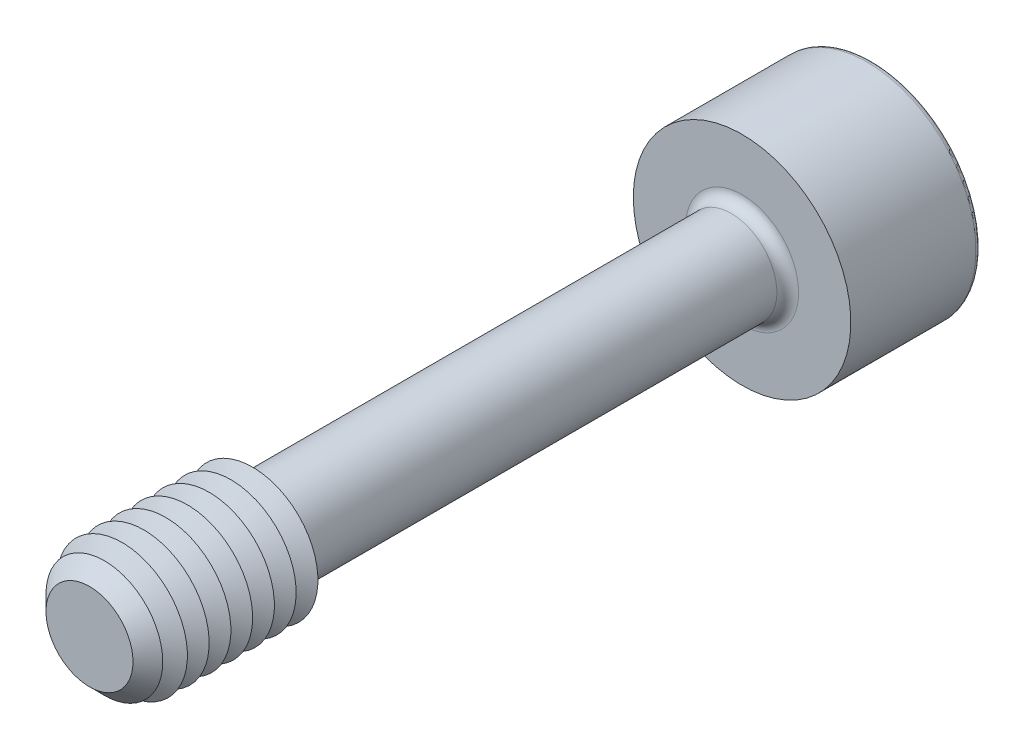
ISO-10303-21;
HEADER;
FILE_DESCRIPTION(('STEP AP214'),'2;1');
FILE_NAME('part.step','',(''),(''),'','','');
FILE_SCHEMA(('AUTOMOTIVE_DESIGN { 1 0 10303 214 1 1 1 1 }'));
ENDSEC;
DATA;
#1=APPLICATION_CONTEXT('core data for automotive mechanical design processes');
#2=APPLICATION_PROTOCOL_DEFINITION('international standard','automotive_design',2000,#1);
#3=PRODUCT_CONTEXT('',#1,'mechanical');
#4=PRODUCT('Part','Part','',(#3));
#5=PRODUCT_RELATED_PRODUCT_CATEGORY('part','',(#4));
#6=PRODUCT_DEFINITION_FORMATION('','',#4);
#7=PRODUCT_DEFINITION_CONTEXT('part definition',#1,'design');
#8=PRODUCT_DEFINITION('design','',#6,#7);
#9=PRODUCT_DEFINITION_SHAPE('','',#8);
#10=(LENGTH_UNIT() NAMED_UNIT(*) SI_UNIT(.MILLI.,.METRE.));
#11=(NAMED_UNIT(*) PLANE_ANGLE_UNIT() SI_UNIT($,.RADIAN.));
#12=(NAMED_UNIT(*) SI_UNIT($,.STERADIAN.) SOLID_ANGLE_UNIT());
#13=UNCERTAINTY_MEASURE_WITH_UNIT(LENGTH_MEASURE(1.E-05),#10,'distance_accuracy_value','');
#14=(GEOMETRIC_REPRESENTATION_CONTEXT(3) GLOBAL_UNCERTAINTY_ASSIGNED_CONTEXT((#13)) GLOBAL_UNIT_ASSIGNED_CONTEXT((#10,
#11,#12)) REPRESENTATION_CONTEXT('',''));
#15=CARTESIAN_POINT('',(0.,0.,0.));
#16=DIRECTION('',(0.,0.,1.));
#17=DIRECTION('',(1.,0.,0.));
#18=AXIS2_PLACEMENT_3D('',#15,#16,#17);
#19=CARTESIAN_POINT('',(-1.44337567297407,-2.5,-16.));
#20=DIRECTION('',(0.,0.,1.));
#21=DIRECTION('',(1.,0.,0.));
#22=AXIS2_PLACEMENT_3D('',#19,#20,#21);
#23=PLANE('',#22);
#24=DIRECTION('',(1.,0.,0.));
#25=VECTOR('',#24,1.);
#26=CARTESIAN_POINT('',(-1.44337567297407,-2.5,-16.));
#27=LINE('',#26,#25);
#28=CARTESIAN_POINT('',(0.,-2.5,-16.));
#29=VERTEX_POINT('',#28);
#30=CARTESIAN_POINT('',(1.44337567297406,-2.5,-16.));
#31=VERTEX_POINT('',#30);
#32=EDGE_CURVE('E729',#29,#31,#27,.T.);
#33=ORIENTED_EDGE('',*,*,#32,.F.);
#34=CARTESIAN_POINT('',(0.,0.,-16.));
#35=DIRECTION('',(0.,0.,1.));
#36=DIRECTION('',(0.,-1.,0.));
#37=AXIS2_PLACEMENT_3D('',#34,#35,#36);
#38=CIRCLE('',#37,2.5);
#39=CARTESIAN_POINT('',(2.1650635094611,-1.25,-16.));
#40=VERTEX_POINT('',#39);
#41=EDGE_CURVE('E53',#29,#40,#38,.T.);
#42=ORIENTED_EDGE('',*,*,#41,.T.);
#43=DIRECTION('',(0.5,0.866025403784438,0.));
#44=VECTOR('',#43,1.);
#45=CARTESIAN_POINT('',(1.44337567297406,-2.5,-16.));
#46=LINE('',#45,#44);
#47=EDGE_CURVE('E714',#31,#40,#46,.T.);
#48=ORIENTED_EDGE('',*,*,#47,.F.);
#49=EDGE_LOOP('',(#33,#42,#48));
#50=FACE_BOUND('',#49,.T.);
#51=ADVANCED_FACE('F41',(#50),#23,.F.);
#52=CARTESIAN_POINT('',(2.88675134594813,0.,-16.));
#53=VERTEX_POINT('',#52);
#54=EDGE_CURVE('E725',#40,#53,#46,.T.);
#55=ORIENTED_EDGE('',*,*,#54,.F.);
#56=CARTESIAN_POINT('',(2.1650635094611,1.25,-16.));
#57=VERTEX_POINT('',#56);
#58=EDGE_CURVE('E11',#40,#57,#38,.T.);
#59=ORIENTED_EDGE('',*,*,#58,.T.);
#60=DIRECTION('',(-0.5,0.866025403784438,0.));
#61=VECTOR('',#60,1.);
#62=CARTESIAN_POINT('',(2.88675134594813,0.,-16.));
#63=LINE('',#62,#61);
#64=EDGE_CURVE('E713',#53,#57,#63,.T.);
#65=ORIENTED_EDGE('',*,*,#64,.F.);
#66=EDGE_LOOP('',(#55,#59,#65));
#67=FACE_BOUND('',#66,.T.);
#68=ADVANCED_FACE('F133',(#67),#23,.F.);
#69=CARTESIAN_POINT('',(1.44337567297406,2.5,-16.));
#70=VERTEX_POINT('',#69);
#71=EDGE_CURVE('E709',#57,#70,#63,.T.);
#72=ORIENTED_EDGE('',*,*,#71,.F.);
#73=CARTESIAN_POINT('',(0.,2.5,-16.));
#74=VERTEX_POINT('',#73);
#75=EDGE_CURVE('E51',#57,#74,#38,.T.);
#76=ORIENTED_EDGE('',*,*,#75,.T.);
#77=DIRECTION('',(-1.,0.,0.));
#78=VECTOR('',#77,1.);
#79=CARTESIAN_POINT('',(1.44337567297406,2.5,-16.));
#80=LINE('',#79,#78);
#81=EDGE_CURVE('E177',#70,#74,#80,.T.);
#82=ORIENTED_EDGE('',*,*,#81,.F.);
#83=EDGE_LOOP('',(#72,#76,#82));
#84=FACE_BOUND('',#83,.T.);
#85=ADVANCED_FACE('F139',(#84),#23,.F.);
#86=CARTESIAN_POINT('',(-1.44337567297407,2.5,-16.));
#87=VERTEX_POINT('',#86);
#88=EDGE_CURVE('E719',#74,#87,#80,.T.);
#89=ORIENTED_EDGE('',*,*,#88,.F.);
#90=CARTESIAN_POINT('',(-2.1650635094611,1.25,-16.));
#91=VERTEX_POINT('',#90);
#92=EDGE_CURVE('E266',#74,#91,#38,.T.);
#93=ORIENTED_EDGE('',*,*,#92,.T.);
#94=DIRECTION('',(-0.5,-0.866025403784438,0.));
#95=VECTOR('',#94,1.);
#96=CARTESIAN_POINT('',(-1.44337567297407,2.5,-16.));
#97=LINE('',#96,#95);
#98=EDGE_CURVE('E176',#87,#91,#97,.T.);
#99=ORIENTED_EDGE('',*,*,#98,.F.);
#100=EDGE_LOOP('',(#89,#93,#99));
#101=FACE_BOUND('',#100,.T.);
#102=ADVANCED_FACE('F157',(#101),#23,.F.);
#103=CARTESIAN_POINT('',(-2.88675134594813,0.,-16.));
#104=VERTEX_POINT('',#103);
#105=EDGE_CURVE('E170',#91,#104,#97,.T.);
#106=ORIENTED_EDGE('',*,*,#105,.F.);
#107=CARTESIAN_POINT('',(-2.1650635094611,-1.25,-16.));
#108=VERTEX_POINT('',#107);
#109=EDGE_CURVE('E172',#91,#108,#38,.T.);
#110=ORIENTED_EDGE('',*,*,#109,.T.);
#111=DIRECTION('',(0.5,-0.866025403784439,0.));
#112=VECTOR('',#111,1.);
#113=CARTESIAN_POINT('',(-2.88675134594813,0.,-16.));
#114=LINE('',#113,#112);
#115=EDGE_CURVE('E174',#104,#108,#114,.T.);
#116=ORIENTED_EDGE('',*,*,#115,.F.);
#117=EDGE_LOOP('',(#106,#110,#116));
#118=FACE_BOUND('',#117,.T.);
#119=ADVANCED_FACE('F146',(#118),#23,.F.);
#120=CARTESIAN_POINT('',(0.,0.,-21.));
#121=DIRECTION('',(0.,0.,-1.));
#122=DIRECTION('',(-1.,0.,0.));
#123=AXIS2_PLACEMENT_3D('',#120,#121,#122);
#124=PLANE('',#123);
#125=CARTESIAN_POINT('',(0.,0.,-21.));
#126=DIRECTION('',(0.,0.,-1.));
#127=DIRECTION('',(-1.,0.,0.));
#128=AXIS2_PLACEMENT_3D('',#125,#126,#127);
#129=CIRCLE('',#128,4.75);
#130=CARTESIAN_POINT('',(-4.75,0.,-21.));
#131=VERTEX_POINT('',#130);
#132=EDGE_CURVE('E251',#131,#131,#129,.T.);
#133=ORIENTED_EDGE('',*,*,#132,.T.);
#134=EDGE_LOOP('',(#133));
#135=FACE_BOUND('',#134,.T.);
#136=DIRECTION('',(-0.5,-0.866025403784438,0.));
#137=VECTOR('',#136,1.);
#138=CARTESIAN_POINT('',(-1.44337567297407,2.5,-21.));
#139=LINE('',#138,#137);
#140=CARTESIAN_POINT('',(-1.44337567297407,2.5,-21.));
#141=VERTEX_POINT('',#140);
#142=CARTESIAN_POINT('',(-2.88675134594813,0.,-21.));
#143=VERTEX_POINT('',#142);
#144=EDGE_CURVE('E212',#141,#143,#139,.T.);
#145=ORIENTED_EDGE('',*,*,#144,.T.);
#146=DIRECTION('',(0.5,-0.866025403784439,0.));
#147=VECTOR('',#146,1.);
#148=CARTESIAN_POINT('',(-2.88675134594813,0.,-21.));
#149=LINE('',#148,#147);
#150=CARTESIAN_POINT('',(-1.44337567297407,-2.5,-21.));
#151=VERTEX_POINT('',#150);
#152=EDGE_CURVE('E67',#143,#151,#149,.T.);
#153=ORIENTED_EDGE('',*,*,#152,.T.);
#154=DIRECTION('',(1.,0.,0.));
#155=VECTOR('',#154,1.);
#156=CARTESIAN_POINT('',(-1.44337567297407,-2.5,-21.));
#157=LINE('',#156,#155);
#158=CARTESIAN_POINT('',(1.44337567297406,-2.5,-21.));
#159=VERTEX_POINT('',#158);
#160=EDGE_CURVE('E196',#151,#159,#157,.T.);
#161=ORIENTED_EDGE('',*,*,#160,.T.);
#162=DIRECTION('',(0.5,0.866025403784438,0.));
#163=VECTOR('',#162,1.);
#164=CARTESIAN_POINT('',(1.44337567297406,-2.5,-21.));
#165=LINE('',#164,#163);
#166=CARTESIAN_POINT('',(2.88675134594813,0.,-21.));
#167=VERTEX_POINT('',#166);
#168=EDGE_CURVE('E200',#159,#167,#165,.T.);
#169=ORIENTED_EDGE('',*,*,#168,.T.);
#170=DIRECTION('',(-0.5,0.866025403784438,0.));
#171=VECTOR('',#170,1.);
#172=CARTESIAN_POINT('',(2.88675134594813,0.,-21.));
#173=LINE('',#172,#171);
#174=CARTESIAN_POINT('',(1.44337567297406,2.5,-21.));
#175=VERTEX_POINT('',#174);
#176=EDGE_CURVE('E204',#167,#175,#173,.T.);
#177=ORIENTED_EDGE('',*,*,#176,.T.);
#178=DIRECTION('',(-1.,0.,0.));
#179=VECTOR('',#178,1.);
#180=CARTESIAN_POINT('',(1.44337567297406,2.5,-21.));
#181=LINE('',#180,#179);
#182=EDGE_CURVE('E208',#175,#141,#181,.T.);
#183=ORIENTED_EDGE('',*,*,#182,.T.);
#184=EDGE_LOOP('',(#145,#153,#161,#169,#177,#183));
#185=FACE_BOUND('',#184,.T.);
#186=ADVANCED_FACE('F156',(#135,#185),#124,.T.);
#187=CARTESIAN_POINT('',(0.,0.,15.));
#188=DIRECTION('',(0.,0.,-1.));
#189=DIRECTION('',(-1.,0.,0.));
#190=AXIS2_PLACEMENT_3D('',#187,#188,#189);
#191=CYLINDRICAL_SURFACE('',#190,2.1);
#192=CARTESIAN_POINT('',(0.,0.,-14.5));
#193=DIRECTION('',(0.,0.,-1.));
#194=DIRECTION('',(-1.,0.,0.));
#195=AXIS2_PLACEMENT_3D('',#192,#193,#194);
#196=CIRCLE('',#195,2.1);
#197=CARTESIAN_POINT('',(-2.1,0.,-14.5));
#198=VERTEX_POINT('',#197);
#199=EDGE_CURVE('E247',#198,#198,#196,.F.);
#200=ORIENTED_EDGE('',*,*,#199,.T.);
#201=EDGE_LOOP('',(#200));
#202=FACE_BOUND('',#201,.T.);
#203=CARTESIAN_POINT('',(0.,0.,6.98038475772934));
#204=DIRECTION('',(0.,0.,-1.));
#205=DIRECTION('',(0.,1.,0.));
#206=AXIS2_PLACEMENT_3D('',#203,#204,#205);
#207=CIRCLE('',#206,2.1);
#208=CARTESIAN_POINT('',(0.,2.1,6.98038475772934));
#209=VERTEX_POINT('',#208);
#210=EDGE_CURVE('E235',#209,#209,#207,.T.);
#211=ORIENTED_EDGE('',*,*,#210,.T.);
#212=EDGE_LOOP('',(#211));
#213=FACE_BOUND('',#212,.T.);
#214=ADVANCED_FACE('F163',(#202,#213),#191,.T.);
#215=CARTESIAN_POINT('',(0.,0.,6.98038475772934));
#216=DIRECTION('',(0.,0.,1.));
#217=DIRECTION('',(0.,-1.,0.));
#218=AXIS2_PLACEMENT_3D('',#215,#216,#217);
#219=CONICAL_SURFACE('',#218,2.1,1.0471975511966);
#220=CARTESIAN_POINT('',(0.,0.,7.5));
#221=DIRECTION('',(0.,0.,-1.));
#222=DIRECTION('',(-1.,0.,0.));
#223=AXIS2_PLACEMENT_3D('',#220,#221,#222);
#224=CIRCLE('',#223,3.);
#225=CARTESIAN_POINT('',(-3.,0.,7.5));
#226=VERTEX_POINT('',#225);
#227=EDGE_CURVE('E270',#226,#226,#224,.T.);
#228=ORIENTED_EDGE('',*,*,#227,.T.);
#229=EDGE_LOOP('',(#228));
#230=FACE_BOUND('',#229,.T.);
#231=ORIENTED_EDGE('',*,*,#210,.F.);
#232=EDGE_LOOP('',(#231));
#233=FACE_BOUND('',#232,.T.);
#234=ADVANCED_FACE('F486',(#230,#233),#219,.T.);
#235=CARTESIAN_POINT('',(0.,0.,-15.));
#236=DIRECTION('',(0.,0.,-1.));
#237=DIRECTION('',(-1.,0.,0.));
#238=AXIS2_PLACEMENT_3D('',#235,#236,#237);
#239=PLANE('',#238);
#240=CARTESIAN_POINT('',(0.,0.,-15.));
#241=DIRECTION('',(0.,0.,-1.));
#242=DIRECTION('',(-1.,0.,0.));
#243=AXIS2_PLACEMENT_3D('',#240,#241,#242);
#244=CIRCLE('',#243,2.6);
#245=CARTESIAN_POINT('',(-2.6,0.,-15.));
#246=VERTEX_POINT('',#245);
#247=EDGE_CURVE('E243',#246,#246,#244,.T.);
#248=ORIENTED_EDGE('',*,*,#247,.T.);
#249=EDGE_LOOP('',(#248));
#250=FACE_BOUND('',#249,.T.);
#251=CARTESIAN_POINT('',(0.,0.,-15.));
#252=DIRECTION('',(0.,0.,-1.));
#253=DIRECTION('',(-1.,0.,0.));
#254=AXIS2_PLACEMENT_3D('',#251,#252,#253);
#255=CIRCLE('',#254,5.);
#256=CARTESIAN_POINT('',(-5.,0.,-15.));
#257=VERTEX_POINT('',#256);
#258=EDGE_CURVE('E231',#257,#257,#255,.T.);
#259=ORIENTED_EDGE('',*,*,#258,.F.);
#260=EDGE_LOOP('',(#259));
#261=FACE_BOUND('',#260,.T.);
#262=ADVANCED_FACE('F479',(#250,#261),#239,.F.);
#263=CARTESIAN_POINT('',(0.,0.,-21.));
#264=DIRECTION('',(0.,0.,1.));
#265=DIRECTION('',(1.,0.,0.));
#266=AXIS2_PLACEMENT_3D('',#263,#264,#265);
#267=CYLINDRICAL_SURFACE('',#266,5.);
#268=CARTESIAN_POINT('',(0.,0.,-20.75));
#269=DIRECTION('',(0.,0.,-1.));
#270=DIRECTION('',(-1.,0.,0.));
#271=AXIS2_PLACEMENT_3D('',#268,#269,#270);
#272=CIRCLE('',#271,5.);
#273=CARTESIAN_POINT('',(-5.,0.,-20.75));
#274=VERTEX_POINT('',#273);
#275=EDGE_CURVE('E254',#274,#274,#272,.F.);
#276=ORIENTED_EDGE('',*,*,#275,.T.);
#277=EDGE_LOOP('',(#276));
#278=FACE_BOUND('',#277,.T.);
#279=ORIENTED_EDGE('',*,*,#258,.T.);
#280=EDGE_LOOP('',(#279));
#281=FACE_BOUND('',#280,.T.);
#282=ADVANCED_FACE('F485',(#278,#281),#267,.T.);
#283=CARTESIAN_POINT('',(-2.88675134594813,0.,-16.));
#284=DIRECTION('',(0.866025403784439,0.5,0.));
#285=DIRECTION('',(-0.5,0.866025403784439,0.));
#286=AXIS2_PLACEMENT_3D('',#283,#284,#285);
#287=PLANE('',#286);
#288=ORIENTED_EDGE('',*,*,#152,.F.);
#289=DIRECTION('',(0.,0.,-1.));
#290=VECTOR('',#289,1.);
#291=CARTESIAN_POINT('',(-2.88675134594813,0.,-16.));
#292=LINE('',#291,#290);
#293=EDGE_CURVE('E186',#104,#143,#292,.T.);
#294=ORIENTED_EDGE('',*,*,#293,.F.);
#295=ORIENTED_EDGE('',*,*,#115,.T.);
#296=CARTESIAN_POINT('',(-1.44337567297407,-2.5,-16.));
#297=VERTEX_POINT('',#296);
#298=EDGE_CURVE('E215',#108,#297,#114,.T.);
#299=ORIENTED_EDGE('',*,*,#298,.T.);
#300=DIRECTION('',(0.,0.,-1.));
#301=VECTOR('',#300,1.);
#302=CARTESIAN_POINT('',(-1.44337567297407,-2.5,-16.));
#303=LINE('',#302,#301);
#304=EDGE_CURVE('E228',#297,#151,#303,.T.);
#305=ORIENTED_EDGE('',*,*,#304,.T.);
#306=EDGE_LOOP('',(#288,#294,#295,#299,#305));
#307=FACE_BOUND('',#306,.T.);
#308=ADVANCED_FACE('F497',(#307),#287,.T.);
#309=CARTESIAN_POINT('',(-1.44337567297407,-2.5,-16.));
#310=DIRECTION('',(0.,1.,0.));
#311=DIRECTION('',(-1.,0.,0.));
#312=AXIS2_PLACEMENT_3D('',#309,#310,#311);
#313=PLANE('',#312);
#314=ORIENTED_EDGE('',*,*,#160,.F.);
#315=ORIENTED_EDGE('',*,*,#304,.F.);
#316=EDGE_CURVE('E726',#297,#29,#27,.T.);
#317=ORIENTED_EDGE('',*,*,#316,.T.);
#318=ORIENTED_EDGE('',*,*,#32,.T.);
#319=DIRECTION('',(0.,0.,-1.));
#320=VECTOR('',#319,1.);
#321=CARTESIAN_POINT('',(1.44337567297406,-2.5,-16.));
#322=LINE('',#321,#320);
#323=EDGE_CURVE('E225',#31,#159,#322,.T.);
#324=ORIENTED_EDGE('',*,*,#323,.T.);
#325=EDGE_LOOP('',(#314,#315,#317,#318,#324));
#326=FACE_BOUND('',#325,.T.);
#327=ADVANCED_FACE('F513',(#326),#313,.T.);
#328=CARTESIAN_POINT('',(1.44337567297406,-2.5,-16.));
#329=DIRECTION('',(-0.866025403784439,0.5,0.));
#330=DIRECTION('',(-0.5,-0.866025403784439,0.));
#331=AXIS2_PLACEMENT_3D('',#328,#329,#330);
#332=PLANE('',#331);
#333=ORIENTED_EDGE('',*,*,#168,.F.);
#334=ORIENTED_EDGE('',*,*,#323,.F.);
#335=ORIENTED_EDGE('',*,*,#47,.T.);
#336=ORIENTED_EDGE('',*,*,#54,.T.);
#337=DIRECTION('',(0.,0.,-1.));
#338=VECTOR('',#337,1.);
#339=CARTESIAN_POINT('',(2.88675134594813,0.,-16.));
#340=LINE('',#339,#338);
#341=EDGE_CURVE('E222',#53,#167,#340,.T.);
#342=ORIENTED_EDGE('',*,*,#341,.T.);
#343=EDGE_LOOP('',(#333,#334,#335,#336,#342));
#344=FACE_BOUND('',#343,.T.);
#345=ADVANCED_FACE('F523',(#344),#332,.T.);
#346=CARTESIAN_POINT('',(2.88675134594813,0.,-16.));
#347=DIRECTION('',(-0.866025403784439,-0.5,0.));
#348=DIRECTION('',(0.5,-0.866025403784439,0.));
#349=AXIS2_PLACEMENT_3D('',#346,#347,#348);
#350=PLANE('',#349);
#351=ORIENTED_EDGE('',*,*,#176,.F.);
#352=ORIENTED_EDGE('',*,*,#341,.F.);
#353=ORIENTED_EDGE('',*,*,#64,.T.);
#354=ORIENTED_EDGE('',*,*,#71,.T.);
#355=DIRECTION('',(0.,0.,-1.));
#356=VECTOR('',#355,1.);
#357=CARTESIAN_POINT('',(1.44337567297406,2.5,-16.));
#358=LINE('',#357,#356);
#359=EDGE_CURVE('E219',#70,#175,#358,.T.);
#360=ORIENTED_EDGE('',*,*,#359,.T.);
#361=EDGE_LOOP('',(#351,#352,#353,#354,#360));
#362=FACE_BOUND('',#361,.T.);
#363=ADVANCED_FACE('F533',(#362),#350,.T.);
#364=CARTESIAN_POINT('',(1.44337567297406,2.5,-16.));
#365=DIRECTION('',(0.,-1.,0.));
#366=DIRECTION('',(0.,0.,-1.));
#367=AXIS2_PLACEMENT_3D('',#364,#365,#366);
#368=PLANE('',#367);
#369=ORIENTED_EDGE('',*,*,#182,.F.);
#370=ORIENTED_EDGE('',*,*,#359,.F.);
#371=ORIENTED_EDGE('',*,*,#81,.T.);
#372=ORIENTED_EDGE('',*,*,#88,.T.);
#373=DIRECTION('',(0.,0.,-1.));
#374=VECTOR('',#373,1.);
#375=CARTESIAN_POINT('',(-1.44337567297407,2.5,-16.));
#376=LINE('',#375,#374);
#377=EDGE_CURVE('E182',#87,#141,#376,.T.);
#378=ORIENTED_EDGE('',*,*,#377,.T.);
#379=EDGE_LOOP('',(#369,#370,#371,#372,#378));
#380=FACE_BOUND('',#379,.T.);
#381=ADVANCED_FACE('F152',(#380),#368,.T.);
#382=CARTESIAN_POINT('',(-1.44337567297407,2.5,-16.));
#383=DIRECTION('',(0.866025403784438,-0.5,0.));
#384=DIRECTION('',(0.5,0.866025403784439,0.));
#385=AXIS2_PLACEMENT_3D('',#382,#383,#384);
#386=PLANE('',#385);
#387=ORIENTED_EDGE('',*,*,#144,.F.);
#388=ORIENTED_EDGE('',*,*,#377,.F.);
#389=ORIENTED_EDGE('',*,*,#98,.T.);
#390=ORIENTED_EDGE('',*,*,#105,.T.);
#391=ORIENTED_EDGE('',*,*,#293,.T.);
#392=EDGE_LOOP('',(#387,#388,#389,#390,#391));
#393=FACE_BOUND('',#392,.T.);
#394=ADVANCED_FACE('F144',(#393),#386,.T.);
#395=ORIENTED_EDGE('',*,*,#298,.F.);
#396=EDGE_CURVE('E257',#108,#29,#38,.T.);
#397=ORIENTED_EDGE('',*,*,#396,.T.);
#398=ORIENTED_EDGE('',*,*,#316,.F.);
#399=EDGE_LOOP('',(#395,#397,#398));
#400=FACE_BOUND('',#399,.T.);
#401=ADVANCED_FACE('F135',(#400),#23,.F.);
#402=CARTESIAN_POINT('',(0.,0.,-14.5));
#403=DIRECTION('',(0.,0.,-1.));
#404=DIRECTION('',(-1.,0.,0.));
#405=AXIS2_PLACEMENT_3D('',#402,#403,#404);
#406=TOROIDAL_SURFACE('',#405,2.6,0.5);
#407=ORIENTED_EDGE('',*,*,#199,.F.);
#408=EDGE_LOOP('',(#407));
#409=FACE_BOUND('',#408,.T.);
#410=ORIENTED_EDGE('',*,*,#247,.F.);
#411=EDGE_LOOP('',(#410));
#412=FACE_BOUND('',#411,.T.);
#413=ADVANCED_FACE('F129',(#409,#412),#406,.F.);
#414=CARTESIAN_POINT('',(0.,0.,-20.75));
#415=DIRECTION('',(0.,0.,-1.));
#416=DIRECTION('',(-1.,0.,0.));
#417=AXIS2_PLACEMENT_3D('',#414,#415,#416);
#418=TOROIDAL_SURFACE('',#417,4.75,0.25);
#419=ORIENTED_EDGE('',*,*,#275,.F.);
#420=EDGE_LOOP('',(#419));
#421=FACE_BOUND('',#420,.T.);
#422=ORIENTED_EDGE('',*,*,#132,.F.);
#423=EDGE_LOOP('',(#422));
#424=FACE_BOUND('',#423,.T.);
#425=ADVANCED_FACE('F43',(#421,#424),#418,.T.);
#426=CARTESIAN_POINT('',(0.,0.,-14.556624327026));
#427=DIRECTION('',(0.,0.,-1.));
#428=DIRECTION('',(0.,1.,0.));
#429=AXIS2_PLACEMENT_3D('',#426,#427,#428);
#430=CONICAL_SURFACE('',#429,0.,1.0471975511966);
#431=ORIENTED_EDGE('',*,*,#41,.F.);
#432=ORIENTED_EDGE('',*,*,#396,.F.);
#433=ORIENTED_EDGE('',*,*,#109,.F.);
#434=ORIENTED_EDGE('',*,*,#92,.F.);
#435=ORIENTED_EDGE('',*,*,#75,.F.);
#436=ORIENTED_EDGE('',*,*,#58,.F.);
#437=EDGE_LOOP('',(#431,#432,#433,#434,#435,#436));
#438=FACE_BOUND('',#437,.T.);
#439=CARTESIAN_POINT('',(0.,0.,-14.556624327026));
#440=VERTEX_POINT('',#439);
#441=VERTEX_LOOP('',#440);
#442=FACE_BOUND('',#441,.T.);
#443=ADVANCED_FACE('F118',(#438,#442),#430,.F.);
#444=CARTESIAN_POINT('',(0.,0.,8.));
#445=DIRECTION('',(0.,0.,-1.));
#446=DIRECTION('',(-1.,0.,0.));
#447=AXIS2_PLACEMENT_3D('',#444,#445,#446);
#448=CONICAL_SURFACE('',#447,2.13397459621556,1.0471975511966);
#449=ORIENTED_EDGE('',*,*,#227,.F.);
#450=EDGE_LOOP('',(#449));
#451=FACE_BOUND('',#450,.T.);
#452=CARTESIAN_POINT('',(0.,0.,8.));
#453=DIRECTION('',(0.,0.,-1.));
#454=DIRECTION('',(-1.,0.,0.));
#455=AXIS2_PLACEMENT_3D('',#452,#453,#454);
#456=CIRCLE('',#455,2.13397459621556);
#457=CARTESIAN_POINT('',(-2.13397459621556,0.,8.));
#458=VERTEX_POINT('',#457);
#459=EDGE_CURVE('E276',#458,#458,#456,.T.);
#460=ORIENTED_EDGE('',*,*,#459,.T.);
#461=EDGE_LOOP('',(#460));
#462=FACE_BOUND('',#461,.T.);
#463=ADVANCED_FACE('F120',(#451,#462),#448,.T.);
#464=CARTESIAN_POINT('',(0.,0.,8.5));
#465=DIRECTION('',(0.,0.,1.));
#466=DIRECTION('',(1.,0.,0.));
#467=AXIS2_PLACEMENT_3D('',#464,#465,#466);
#468=CONICAL_SURFACE('',#467,3.,1.0471975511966);
#469=ORIENTED_EDGE('',*,*,#459,.F.);
#470=EDGE_LOOP('',(#469));
#471=FACE_BOUND('',#470,.T.);
#472=CARTESIAN_POINT('',(0.,0.,8.5));
#473=DIRECTION('',(0.,0.,-1.));
#474=DIRECTION('',(-1.,0.,0.));
#475=AXIS2_PLACEMENT_3D('',#472,#473,#474);
#476=CIRCLE('',#475,3.);
#477=CARTESIAN_POINT('',(-3.,0.,8.5));
#478=VERTEX_POINT('',#477);
#479=EDGE_CURVE('E283',#478,#478,#476,.T.);
#480=ORIENTED_EDGE('',*,*,#479,.T.);
#481=EDGE_LOOP('',(#480));
#482=FACE_BOUND('',#481,.T.);
#483=ADVANCED_FACE('F126',(#471,#482),#468,.T.);
#484=CARTESIAN_POINT('',(0.,0.,9.));
#485=DIRECTION('',(0.,0.,-1.));
#486=DIRECTION('',(-1.,0.,0.));
#487=AXIS2_PLACEMENT_3D('',#484,#485,#486);
#488=CONICAL_SURFACE('',#487,2.13397459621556,1.0471975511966);
#489=ORIENTED_EDGE('',*,*,#479,.F.);
#490=EDGE_LOOP('',(#489));
#491=FACE_BOUND('',#490,.T.);
#492=CARTESIAN_POINT('',(0.,0.,9.));
#493=DIRECTION('',(0.,0.,-1.));
#494=DIRECTION('',(-1.,0.,0.));
#495=AXIS2_PLACEMENT_3D('',#492,#493,#494);
#496=CIRCLE('',#495,2.13397459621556);
#497=CARTESIAN_POINT('',(-2.13397459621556,0.,9.));
#498=VERTEX_POINT('',#497);
#499=EDGE_CURVE('E288',#498,#498,#496,.T.);
#500=ORIENTED_EDGE('',*,*,#499,.T.);
#501=EDGE_LOOP('',(#500));
#502=FACE_BOUND('',#501,.T.);
#503=ADVANCED_FACE('F383',(#491,#502),#488,.T.);
#504=CARTESIAN_POINT('',(0.,0.,9.5));
#505=DIRECTION('',(0.,0.,1.));
#506=DIRECTION('',(1.,0.,0.));
#507=AXIS2_PLACEMENT_3D('',#504,#505,#506);
#508=CONICAL_SURFACE('',#507,3.,1.0471975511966);
#509=ORIENTED_EDGE('',*,*,#499,.F.);
#510=EDGE_LOOP('',(#509));
#511=FACE_BOUND('',#510,.T.);
#512=CARTESIAN_POINT('',(0.,0.,9.5));
#513=DIRECTION('',(0.,0.,-1.));
#514=DIRECTION('',(-1.,0.,0.));
#515=AXIS2_PLACEMENT_3D('',#512,#513,#514);
#516=CIRCLE('',#515,3.);
#517=CARTESIAN_POINT('',(-3.,0.,9.5));
#518=VERTEX_POINT('',#517);
#519=EDGE_CURVE('E292',#518,#518,#516,.T.);
#520=ORIENTED_EDGE('',*,*,#519,.T.);
#521=EDGE_LOOP('',(#520));
#522=FACE_BOUND('',#521,.T.);
#523=ADVANCED_FACE('F379',(#511,#522),#508,.T.);
#524=CARTESIAN_POINT('',(0.,0.,10.));
#525=DIRECTION('',(0.,0.,-1.));
#526=DIRECTION('',(-1.,0.,0.));
#527=AXIS2_PLACEMENT_3D('',#524,#525,#526);
#528=CONICAL_SURFACE('',#527,2.13397459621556,1.0471975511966);
#529=ORIENTED_EDGE('',*,*,#519,.F.);
#530=EDGE_LOOP('',(#529));
#531=FACE_BOUND('',#530,.T.);
#532=CARTESIAN_POINT('',(0.,0.,10.));
#533=DIRECTION('',(0.,0.,-1.));
#534=DIRECTION('',(-1.,0.,0.));
#535=AXIS2_PLACEMENT_3D('',#532,#533,#534);
#536=CIRCLE('',#535,2.13397459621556);
#537=CARTESIAN_POINT('',(-2.13397459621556,0.,10.));
#538=VERTEX_POINT('',#537);
#539=EDGE_CURVE('E296',#538,#538,#536,.T.);
#540=ORIENTED_EDGE('',*,*,#539,.T.);
#541=EDGE_LOOP('',(#540));
#542=FACE_BOUND('',#541,.T.);
#543=ADVANCED_FACE('F375',(#531,#542),#528,.T.);
#544=CARTESIAN_POINT('',(0.,0.,10.5));
#545=DIRECTION('',(0.,0.,1.));
#546=DIRECTION('',(1.,0.,0.));
#547=AXIS2_PLACEMENT_3D('',#544,#545,#546);
#548=CONICAL_SURFACE('',#547,3.,1.0471975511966);
#549=ORIENTED_EDGE('',*,*,#539,.F.);
#550=EDGE_LOOP('',(#549));
#551=FACE_BOUND('',#550,.T.);
#552=CARTESIAN_POINT('',(0.,0.,10.5));
#553=DIRECTION('',(0.,0.,-1.));
#554=DIRECTION('',(-1.,0.,0.));
#555=AXIS2_PLACEMENT_3D('',#552,#553,#554);
#556=CIRCLE('',#555,3.);
#557=CARTESIAN_POINT('',(-3.,0.,10.5));
#558=VERTEX_POINT('',#557);
#559=EDGE_CURVE('E300',#558,#558,#556,.T.);
#560=ORIENTED_EDGE('',*,*,#559,.T.);
#561=EDGE_LOOP('',(#560));
#562=FACE_BOUND('',#561,.T.);
#563=ADVANCED_FACE('F371',(#551,#562),#548,.T.);
#564=CARTESIAN_POINT('',(0.,0.,11.));
#565=DIRECTION('',(0.,0.,-1.));
#566=DIRECTION('',(-1.,0.,0.));
#567=AXIS2_PLACEMENT_3D('',#564,#565,#566);
#568=CONICAL_SURFACE('',#567,2.13397459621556,1.0471975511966);
#569=ORIENTED_EDGE('',*,*,#559,.F.);
#570=EDGE_LOOP('',(#569));
#571=FACE_BOUND('',#570,.T.);
#572=CARTESIAN_POINT('',(0.,0.,11.));
#573=DIRECTION('',(0.,0.,-1.));
#574=DIRECTION('',(-1.,0.,0.));
#575=AXIS2_PLACEMENT_3D('',#572,#573,#574);
#576=CIRCLE('',#575,2.13397459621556);
#577=CARTESIAN_POINT('',(-2.13397459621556,0.,11.));
#578=VERTEX_POINT('',#577);
#579=EDGE_CURVE('E304',#578,#578,#576,.T.);
#580=ORIENTED_EDGE('',*,*,#579,.T.);
#581=EDGE_LOOP('',(#580));
#582=FACE_BOUND('',#581,.T.);
#583=ADVANCED_FACE('F367',(#571,#582),#568,.T.);
#584=CARTESIAN_POINT('',(0.,0.,11.5));
#585=DIRECTION('',(0.,0.,1.));
#586=DIRECTION('',(1.,0.,0.));
#587=AXIS2_PLACEMENT_3D('',#584,#585,#586);
#588=CONICAL_SURFACE('',#587,3.,1.0471975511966);
#589=ORIENTED_EDGE('',*,*,#579,.F.);
#590=EDGE_LOOP('',(#589));
#591=FACE_BOUND('',#590,.T.);
#592=CARTESIAN_POINT('',(0.,0.,11.5));
#593=DIRECTION('',(0.,0.,-1.));
#594=DIRECTION('',(-1.,0.,0.));
#595=AXIS2_PLACEMENT_3D('',#592,#593,#594);
#596=CIRCLE('',#595,3.);
#597=CARTESIAN_POINT('',(-3.,0.,11.5));
#598=VERTEX_POINT('',#597);
#599=EDGE_CURVE('E307',#598,#598,#596,.T.);
#600=ORIENTED_EDGE('',*,*,#599,.T.);
#601=EDGE_LOOP('',(#600));
#602=FACE_BOUND('',#601,.T.);
#603=ADVANCED_FACE('F363',(#591,#602),#588,.T.);
#604=CARTESIAN_POINT('',(0.,0.,12.));
#605=DIRECTION('',(0.,0.,-1.));
#606=DIRECTION('',(-1.,0.,0.));
#607=AXIS2_PLACEMENT_3D('',#604,#605,#606);
#608=CONICAL_SURFACE('',#607,2.13397459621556,1.0471975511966);
#609=ORIENTED_EDGE('',*,*,#599,.F.);
#610=EDGE_LOOP('',(#609));
#611=FACE_BOUND('',#610,.T.);
#612=CARTESIAN_POINT('',(0.,0.,12.));
#613=DIRECTION('',(0.,0.,-1.));
#614=DIRECTION('',(-1.,0.,0.));
#615=AXIS2_PLACEMENT_3D('',#612,#613,#614);
#616=CIRCLE('',#615,2.13397459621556);
#617=CARTESIAN_POINT('',(-2.13397459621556,0.,12.));
#618=VERTEX_POINT('',#617);
#619=EDGE_CURVE('E310',#618,#618,#616,.T.);
#620=ORIENTED_EDGE('',*,*,#619,.T.);
#621=EDGE_LOOP('',(#620));
#622=FACE_BOUND('',#621,.T.);
#623=ADVANCED_FACE('F359',(#611,#622),#608,.T.);
#624=CARTESIAN_POINT('',(0.,0.,12.5));
#625=DIRECTION('',(0.,0.,1.));
#626=DIRECTION('',(1.,0.,0.));
#627=AXIS2_PLACEMENT_3D('',#624,#625,#626);
#628=CONICAL_SURFACE('',#627,3.,1.0471975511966);
#629=ORIENTED_EDGE('',*,*,#619,.F.);
#630=EDGE_LOOP('',(#629));
#631=FACE_BOUND('',#630,.T.);
#632=CARTESIAN_POINT('',(0.,0.,12.5));
#633=DIRECTION('',(0.,0.,-1.));
#634=DIRECTION('',(-1.,0.,0.));
#635=AXIS2_PLACEMENT_3D('',#632,#633,#634);
#636=CIRCLE('',#635,3.);
#637=CARTESIAN_POINT('',(-3.,0.,12.5));
#638=VERTEX_POINT('',#637);
#639=EDGE_CURVE('E313',#638,#638,#636,.T.);
#640=ORIENTED_EDGE('',*,*,#639,.T.);
#641=EDGE_LOOP('',(#640));
#642=FACE_BOUND('',#641,.T.);
#643=ADVANCED_FACE('F355',(#631,#642),#628,.T.);
#644=CARTESIAN_POINT('',(0.,0.,13.));
#645=DIRECTION('',(0.,0.,-1.));
#646=DIRECTION('',(-1.,0.,0.));
#647=AXIS2_PLACEMENT_3D('',#644,#645,#646);
#648=CONICAL_SURFACE('',#647,2.13397459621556,1.0471975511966);
#649=ORIENTED_EDGE('',*,*,#639,.F.);
#650=EDGE_LOOP('',(#649));
#651=FACE_BOUND('',#650,.T.);
#652=CARTESIAN_POINT('',(0.,0.,13.));
#653=DIRECTION('',(0.,0.,-1.));
#654=DIRECTION('',(-1.,0.,0.));
#655=AXIS2_PLACEMENT_3D('',#652,#653,#654);
#656=CIRCLE('',#655,2.13397459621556);
#657=CARTESIAN_POINT('',(-2.13397459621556,0.,13.));
#658=VERTEX_POINT('',#657);
#659=EDGE_CURVE('E317',#658,#658,#656,.T.);
#660=ORIENTED_EDGE('',*,*,#659,.T.);
#661=EDGE_LOOP('',(#660));
#662=FACE_BOUND('',#661,.T.);
#663=ADVANCED_FACE('F351',(#651,#662),#648,.T.);
#664=CARTESIAN_POINT('',(0.,0.,13.5));
#665=DIRECTION('',(0.,0.,1.));
#666=DIRECTION('',(1.,0.,0.));
#667=AXIS2_PLACEMENT_3D('',#664,#665,#666);
#668=CONICAL_SURFACE('',#667,3.,1.0471975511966);
#669=ORIENTED_EDGE('',*,*,#659,.F.);
#670=EDGE_LOOP('',(#669));
#671=FACE_BOUND('',#670,.T.);
#672=CARTESIAN_POINT('',(0.,0.,13.5));
#673=DIRECTION('',(0.,0.,-1.));
#674=DIRECTION('',(-1.,0.,0.));
#675=AXIS2_PLACEMENT_3D('',#672,#673,#674);
#676=CIRCLE('',#675,3.);
#677=CARTESIAN_POINT('',(-3.,0.,13.5));
#678=VERTEX_POINT('',#677);
#679=EDGE_CURVE('E320',#678,#678,#676,.T.);
#680=ORIENTED_EDGE('',*,*,#679,.T.);
#681=EDGE_LOOP('',(#680));
#682=FACE_BOUND('',#681,.T.);
#683=ADVANCED_FACE('F344',(#671,#682),#668,.T.);
#684=CARTESIAN_POINT('',(0.,0.,14.));
#685=DIRECTION('',(0.,0.,-1.));
#686=DIRECTION('',(-1.,0.,0.));
#687=AXIS2_PLACEMENT_3D('',#684,#685,#686);
#688=CONICAL_SURFACE('',#687,2.13397459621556,1.0471975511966);
#689=ORIENTED_EDGE('',*,*,#679,.F.);
#690=EDGE_LOOP('',(#689));
#691=FACE_BOUND('',#690,.T.);
#692=CARTESIAN_POINT('',(0.,0.,14.));
#693=DIRECTION('',(0.,0.,-1.));
#694=DIRECTION('',(-1.,0.,0.));
#695=AXIS2_PLACEMENT_3D('',#692,#693,#694);
#696=CIRCLE('',#695,2.13397459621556);
#697=CARTESIAN_POINT('',(-2.13397459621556,0.,14.));
#698=VERTEX_POINT('',#697);
#699=EDGE_CURVE('E324',#698,#698,#696,.T.);
#700=ORIENTED_EDGE('',*,*,#699,.T.);
#701=EDGE_LOOP('',(#700));
#702=FACE_BOUND('',#701,.T.);
#703=ADVANCED_FACE('F330',(#691,#702),#688,.T.);
#704=CARTESIAN_POINT('',(0.,0.,14.5));
#705=DIRECTION('',(0.,0.,1.));
#706=DIRECTION('',(1.,0.,0.));
#707=AXIS2_PLACEMENT_3D('',#704,#705,#706);
#708=CONICAL_SURFACE('',#707,3.,1.0471975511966);
#709=CARTESIAN_POINT('',(0.,0.,14.3169872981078));
#710=DIRECTION('',(0.,0.,1.));
#711=DIRECTION('',(1.,0.,0.));
#712=AXIS2_PLACEMENT_3D('',#709,#710,#711);
#713=CIRCLE('',#712,2.68301270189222);
#714=CARTESIAN_POINT('',(2.68301270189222,0.,14.3169872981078));
#715=VERTEX_POINT('',#714);
#716=EDGE_CURVE('E45',#715,#715,#713,.F.);
#717=ORIENTED_EDGE('',*,*,#716,.T.);
#718=EDGE_LOOP('',(#717));
#719=FACE_BOUND('',#718,.T.);
#720=ORIENTED_EDGE('',*,*,#699,.F.);
#721=EDGE_LOOP('',(#720));
#722=FACE_BOUND('',#721,.T.);
#723=ADVANCED_FACE('F332',(#719,#722),#708,.T.);
#724=CARTESIAN_POINT('',(0.,0.,15.));
#725=DIRECTION('',(0.,0.,1.));
#726=DIRECTION('',(1.,0.,0.));
#727=AXIS2_PLACEMENT_3D('',#724,#725,#726);
#728=PLANE('',#727);
#729=CARTESIAN_POINT('',(0.,0.,15.));
#730=DIRECTION('',(0.,0.,1.));
#731=DIRECTION('',(1.,0.,0.));
#732=AXIS2_PLACEMENT_3D('',#729,#730,#731);
#733=CIRCLE('',#732,2.);
#734=CARTESIAN_POINT('',(2.,0.,15.));
#735=VERTEX_POINT('',#734);
#736=EDGE_CURVE('E239',#735,#735,#733,.T.);
#737=ORIENTED_EDGE('',*,*,#736,.T.);
#738=EDGE_LOOP('',(#737));
#739=FACE_BOUND('',#738,.T.);
#740=ADVANCED_FACE('F334',(#739),#728,.T.);
#741=CARTESIAN_POINT('',(0.,0.,14.));
#742=DIRECTION('',(0.,0.,-1.));
#743=DIRECTION('',(0.,1.,0.));
#744=AXIS2_PLACEMENT_3D('',#741,#742,#743);
#745=CONICAL_SURFACE('',#744,3.,0.78539816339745);
#746=ORIENTED_EDGE('',*,*,#716,.F.);
#747=EDGE_LOOP('',(#746));
#748=FACE_BOUND('',#747,.T.);
#749=ORIENTED_EDGE('',*,*,#736,.F.);
#750=EDGE_LOOP('',(#749));
#751=FACE_BOUND('',#750,.T.);
#752=ADVANCED_FACE('F341',(#748,#751),#745,.T.);
#753=CLOSED_SHELL('',(#51,#68,#85,#102,#119,#186,#214,#234,#262,#282,#308,#327,#345,#363,#381,
#394,#401,#413,#425,#443,#463,#483,#503,#523,#543,#563,#583,#603,#623,#643,#663,#683,#703,#723,
#740,#752));
#754=MANIFOLD_SOLID_BREP('B2',#753);
#755=ADVANCED_BREP_SHAPE_REPRESENTATION('',(#18,#754),#14);
#756=SHAPE_DEFINITION_REPRESENTATION(#9,#755);
ENDSEC;
END-ISO-10303-21;
